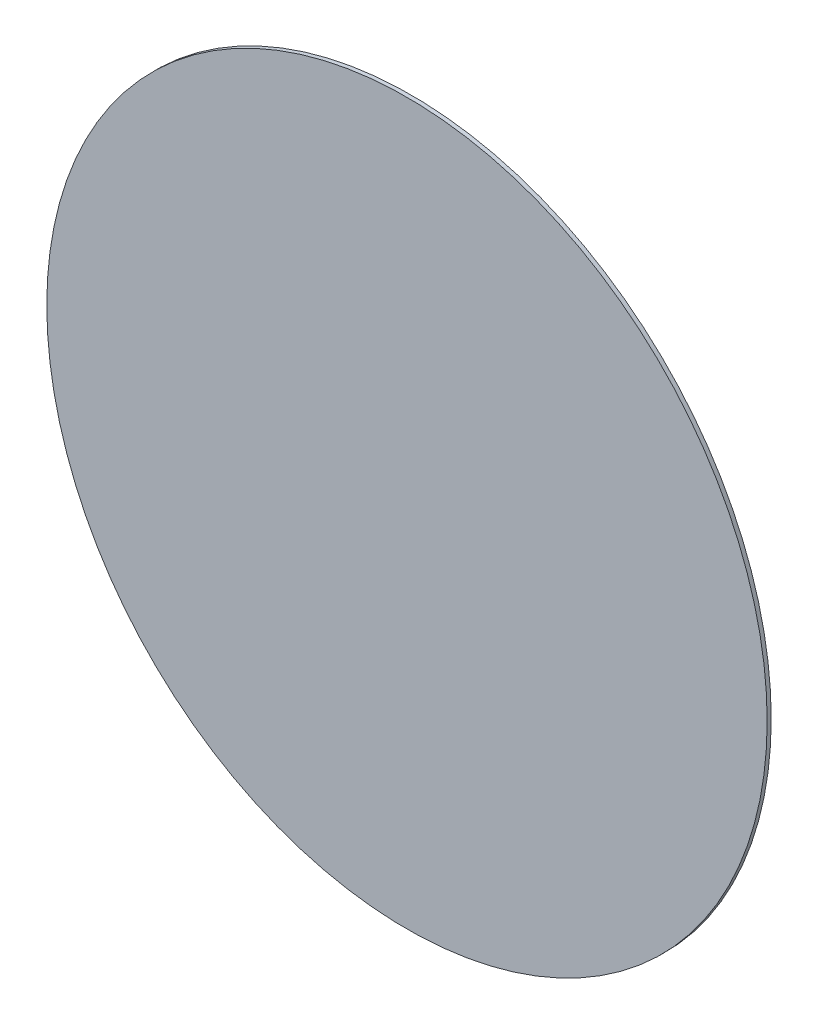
ISO-10303-21;
HEADER;
FILE_DESCRIPTION(('STEP AP214'),'2;1');
FILE_NAME('part.step','',(''),(''),'','','');
FILE_SCHEMA(('AUTOMOTIVE_DESIGN { 1 0 10303 214 1 1 1 1 }'));
ENDSEC;
DATA;
#1=APPLICATION_CONTEXT('core data for automotive mechanical design processes');
#2=APPLICATION_PROTOCOL_DEFINITION('international standard','automotive_design',2000,#1);
#3=PRODUCT_CONTEXT('',#1,'mechanical');
#4=PRODUCT('Part','Part','',(#3));
#5=PRODUCT_RELATED_PRODUCT_CATEGORY('part','',(#4));
#6=PRODUCT_DEFINITION_FORMATION('','',#4);
#7=PRODUCT_DEFINITION_CONTEXT('part definition',#1,'design');
#8=PRODUCT_DEFINITION('design','',#6,#7);
#9=PRODUCT_DEFINITION_SHAPE('','',#8);
#10=(LENGTH_UNIT() NAMED_UNIT(*) SI_UNIT(.MILLI.,.METRE.));
#11=(NAMED_UNIT(*) PLANE_ANGLE_UNIT() SI_UNIT($,.RADIAN.));
#12=(NAMED_UNIT(*) SI_UNIT($,.STERADIAN.) SOLID_ANGLE_UNIT());
#13=UNCERTAINTY_MEASURE_WITH_UNIT(LENGTH_MEASURE(1.E-05),#10,'distance_accuracy_value','');
#14=(GEOMETRIC_REPRESENTATION_CONTEXT(3) GLOBAL_UNCERTAINTY_ASSIGNED_CONTEXT((#13)) GLOBAL_UNIT_ASSIGNED_CONTEXT((#10,
#11,#12)) REPRESENTATION_CONTEXT('',''));
#15=CARTESIAN_POINT('',(0.,0.,0.));
#16=DIRECTION('',(0.,0.,1.));
#17=DIRECTION('',(1.,0.,0.));
#18=AXIS2_PLACEMENT_3D('',#15,#16,#17);
#19=CARTESIAN_POINT('',(0.,0.,2.));
#20=DIRECTION('',(0.,0.,-1.));
#21=DIRECTION('',(-1.,0.,0.));
#22=AXIS2_PLACEMENT_3D('',#19,#20,#21);
#23=CYLINDRICAL_SURFACE('',#22,178.);
#24=CARTESIAN_POINT('',(0.,0.,2.));
#25=DIRECTION('',(0.,0.,1.));
#26=DIRECTION('',(1.,0.,0.));
#27=AXIS2_PLACEMENT_3D('',#24,#25,#26);
#28=CIRCLE('',#27,178.);
#29=CARTESIAN_POINT('',(178.,0.,2.));
#30=VERTEX_POINT('',#29);
#31=EDGE_CURVE('E10',#30,#30,#28,.T.);
#32=ORIENTED_EDGE('',*,*,#31,.F.);
#33=EDGE_LOOP('',(#32));
#34=FACE_BOUND('',#33,.T.);
#35=CARTESIAN_POINT('',(0.,0.,0.));
#36=DIRECTION('',(0.,0.,1.));
#37=DIRECTION('',(1.,0.,0.));
#38=AXIS2_PLACEMENT_3D('',#35,#36,#37);
#39=CIRCLE('',#38,178.);
#40=CARTESIAN_POINT('',(178.,0.,0.));
#41=VERTEX_POINT('',#40);
#42=EDGE_CURVE('E40',#41,#41,#39,.T.);
#43=ORIENTED_EDGE('',*,*,#42,.T.);
#44=EDGE_LOOP('',(#43));
#45=FACE_BOUND('',#44,.T.);
#46=ADVANCED_FACE('F37',(#34,#45),#23,.T.);
#47=CARTESIAN_POINT('',(0.,0.,2.));
#48=DIRECTION('',(0.,0.,1.));
#49=DIRECTION('',(1.,0.,0.));
#50=AXIS2_PLACEMENT_3D('',#47,#48,#49);
#51=PLANE('',#50);
#52=ORIENTED_EDGE('',*,*,#31,.T.);
#53=EDGE_LOOP('',(#52));
#54=FACE_BOUND('',#53,.T.);
#55=ADVANCED_FACE('F54',(#54),#51,.T.);
#56=CARTESIAN_POINT('',(0.,0.,0.));
#57=DIRECTION('',(0.,0.,1.));
#58=DIRECTION('',(1.,0.,0.));
#59=AXIS2_PLACEMENT_3D('',#56,#57,#58);
#60=PLANE('',#59);
#61=ORIENTED_EDGE('',*,*,#42,.F.);
#62=EDGE_LOOP('',(#61));
#63=FACE_BOUND('',#62,.T.);
#64=ADVANCED_FACE('F52',(#63),#60,.F.);
#65=CLOSED_SHELL('',(#46,#55,#64));
#66=MANIFOLD_SOLID_BREP('B2',#65);
#67=ADVANCED_BREP_SHAPE_REPRESENTATION('',(#18,#66),#14);
#68=SHAPE_DEFINITION_REPRESENTATION(#9,#67);
ENDSEC;
END-ISO-10303-21;
